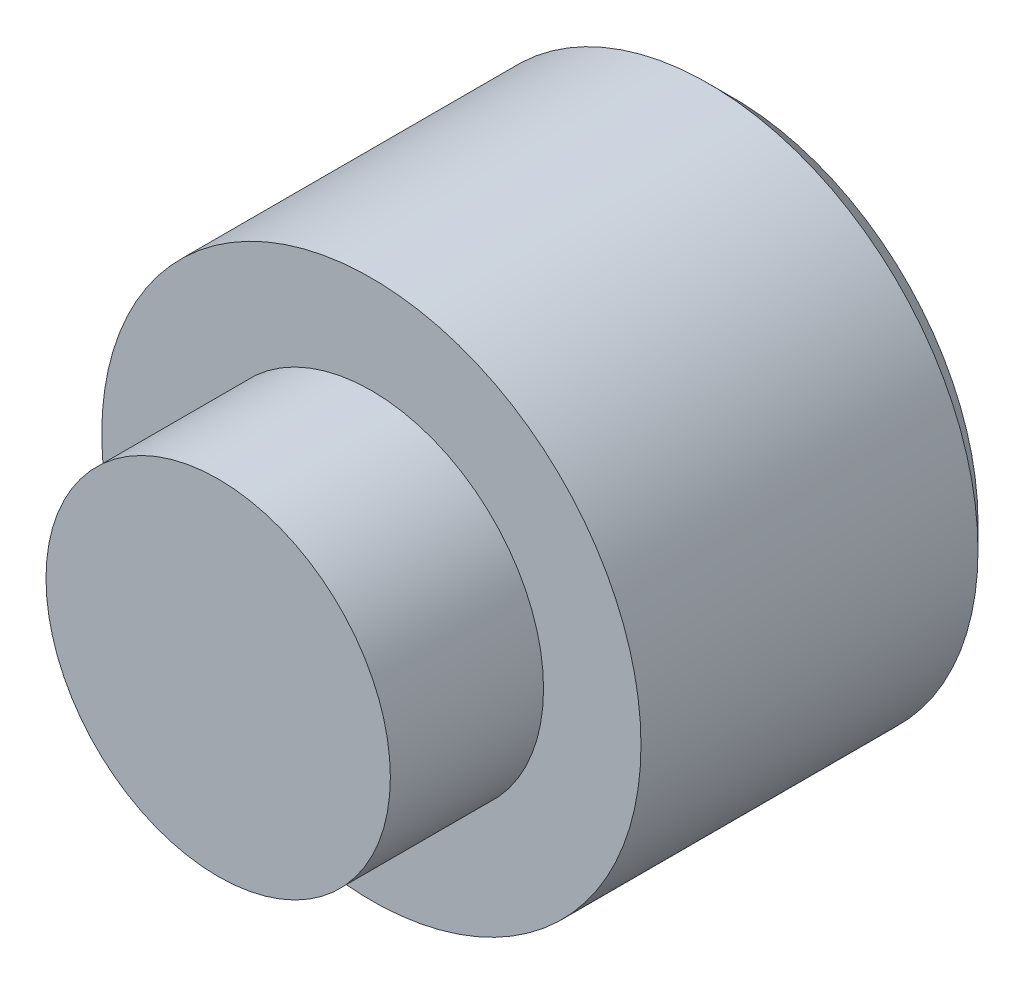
ISO-10303-21;
HEADER;
FILE_DESCRIPTION(('STEP AP214'),'2;1');
FILE_NAME('part.step','',(''),(''),'','','');
FILE_SCHEMA(('AUTOMOTIVE_DESIGN { 1 0 10303 214 1 1 1 1 }'));
ENDSEC;
DATA;
#1=APPLICATION_CONTEXT('core data for automotive mechanical design processes');
#2=APPLICATION_PROTOCOL_DEFINITION('international standard','automotive_design',2000,#1);
#3=PRODUCT_CONTEXT('',#1,'mechanical');
#4=PRODUCT('Part','Part','',(#3));
#5=PRODUCT_RELATED_PRODUCT_CATEGORY('part','',(#4));
#6=PRODUCT_DEFINITION_FORMATION('','',#4);
#7=PRODUCT_DEFINITION_CONTEXT('part definition',#1,'design');
#8=PRODUCT_DEFINITION('design','',#6,#7);
#9=PRODUCT_DEFINITION_SHAPE('','',#8);
#10=(LENGTH_UNIT() NAMED_UNIT(*) SI_UNIT(.MILLI.,.METRE.));
#11=(NAMED_UNIT(*) PLANE_ANGLE_UNIT() SI_UNIT($,.RADIAN.));
#12=(NAMED_UNIT(*) SI_UNIT($,.STERADIAN.) SOLID_ANGLE_UNIT());
#13=UNCERTAINTY_MEASURE_WITH_UNIT(LENGTH_MEASURE(1.E-05),#10,'distance_accuracy_value','');
#14=(GEOMETRIC_REPRESENTATION_CONTEXT(3) GLOBAL_UNCERTAINTY_ASSIGNED_CONTEXT((#13)) GLOBAL_UNIT_ASSIGNED_CONTEXT((#10,
#11,#12)) REPRESENTATION_CONTEXT('',''));
#15=CARTESIAN_POINT('',(0.,0.,0.));
#16=DIRECTION('',(0.,0.,1.));
#17=DIRECTION('',(1.,0.,0.));
#18=AXIS2_PLACEMENT_3D('',#15,#16,#17);
#19=CARTESIAN_POINT('',(0.,0.,3.175));
#20=DIRECTION('',(0.,0.,-1.));
#21=DIRECTION('',(-1.,0.,0.));
#22=AXIS2_PLACEMENT_3D('',#19,#20,#21);
#23=CYLINDRICAL_SURFACE('',#22,3.5687);
#24=CARTESIAN_POINT('',(0.,0.,3.175));
#25=DIRECTION('',(0.,0.,1.));
#26=DIRECTION('',(1.,0.,0.));
#27=AXIS2_PLACEMENT_3D('',#24,#25,#26);
#28=CIRCLE('',#27,3.5687);
#29=CARTESIAN_POINT('',(3.5687,0.,3.175));
#30=VERTEX_POINT('',#29);
#31=EDGE_CURVE('E46',#30,#30,#28,.T.);
#32=ORIENTED_EDGE('',*,*,#31,.F.);
#33=EDGE_LOOP('',(#32));
#34=FACE_BOUND('',#33,.T.);
#35=CARTESIAN_POINT('',(0.,0.,0.));
#36=DIRECTION('',(0.,0.,-1.));
#37=DIRECTION('',(-1.,0.,0.));
#38=AXIS2_PLACEMENT_3D('',#35,#36,#37);
#39=CIRCLE('',#38,3.5687);
#40=CARTESIAN_POINT('',(-3.5687,0.,0.));
#41=VERTEX_POINT('',#40);
#42=EDGE_CURVE('E50',#41,#41,#39,.T.);
#43=ORIENTED_EDGE('',*,*,#42,.F.);
#44=EDGE_LOOP('',(#43));
#45=FACE_BOUND('',#44,.T.);
#46=ADVANCED_FACE('F35',(#34,#45),#23,.T.);
#47=CARTESIAN_POINT('',(0.,0.,3.175));
#48=DIRECTION('',(0.,0.,1.));
#49=DIRECTION('',(1.,0.,0.));
#50=AXIS2_PLACEMENT_3D('',#47,#48,#49);
#51=PLANE('',#50);
#52=ORIENTED_EDGE('',*,*,#31,.T.);
#53=EDGE_LOOP('',(#52));
#54=FACE_BOUND('',#53,.T.);
#55=ADVANCED_FACE('F64',(#54),#51,.T.);
#56=CARTESIAN_POINT('',(0.,0.,0.));
#57=DIRECTION('',(0.,0.,-1.));
#58=DIRECTION('',(-1.,0.,0.));
#59=AXIS2_PLACEMENT_3D('',#56,#57,#58);
#60=PLANE('',#59);
#61=CARTESIAN_POINT('',(0.,0.,0.));
#62=DIRECTION('',(0.,0.,-1.));
#63=DIRECTION('',(-1.,0.,0.));
#64=AXIS2_PLACEMENT_3D('',#61,#62,#63);
#65=CIRCLE('',#64,5.588);
#66=CARTESIAN_POINT('',(-5.588,0.,0.));
#67=VERTEX_POINT('',#66);
#68=EDGE_CURVE('E55',#67,#67,#65,.T.);
#69=ORIENTED_EDGE('',*,*,#68,.F.);
#70=EDGE_LOOP('',(#69));
#71=FACE_BOUND('',#70,.T.);
#72=ORIENTED_EDGE('',*,*,#42,.T.);
#73=EDGE_LOOP('',(#72));
#74=FACE_BOUND('',#73,.T.);
#75=ADVANCED_FACE('F61',(#71,#74),#60,.F.);
#76=CARTESIAN_POINT('',(0.,0.,-7.493));
#77=DIRECTION('',(0.,0.,1.));
#78=DIRECTION('',(1.,0.,0.));
#79=AXIS2_PLACEMENT_3D('',#76,#77,#78);
#80=CYLINDRICAL_SURFACE('',#79,5.588);
#81=CARTESIAN_POINT('',(0.,0.,-6.985));
#82=DIRECTION('',(0.,0.,-1.));
#83=DIRECTION('',(-1.,0.,0.));
#84=AXIS2_PLACEMENT_3D('',#81,#82,#83);
#85=CIRCLE('',#84,5.588);
#86=CARTESIAN_POINT('',(-5.588,0.,-6.985));
#87=VERTEX_POINT('',#86);
#88=EDGE_CURVE('E10',#87,#87,#85,.F.);
#89=ORIENTED_EDGE('',*,*,#88,.T.);
#90=EDGE_LOOP('',(#89));
#91=FACE_BOUND('',#90,.T.);
#92=ORIENTED_EDGE('',*,*,#68,.T.);
#93=EDGE_LOOP('',(#92));
#94=FACE_BOUND('',#93,.T.);
#95=ADVANCED_FACE('F59',(#91,#94),#80,.T.);
#96=CARTESIAN_POINT('',(0.,0.,-7.493));
#97=DIRECTION('',(0.,0.,-1.));
#98=DIRECTION('',(-1.,0.,0.));
#99=AXIS2_PLACEMENT_3D('',#96,#97,#98);
#100=PLANE('',#99);
#101=CARTESIAN_POINT('',(0.,0.,-7.493));
#102=DIRECTION('',(0.,0.,-1.));
#103=DIRECTION('',(-1.,0.,0.));
#104=AXIS2_PLACEMENT_3D('',#101,#102,#103);
#105=CIRCLE('',#104,5.08);
#106=CARTESIAN_POINT('',(-5.08,0.,-7.493));
#107=VERTEX_POINT('',#106);
#108=EDGE_CURVE('E42',#107,#107,#105,.T.);
#109=ORIENTED_EDGE('',*,*,#108,.T.);
#110=EDGE_LOOP('',(#109));
#111=FACE_BOUND('',#110,.T.);
#112=ADVANCED_FACE('F78',(#111),#100,.T.);
#113=CARTESIAN_POINT('',(0.,0.,-7.493));
#114=DIRECTION('',(0.,0.,1.));
#115=DIRECTION('',(1.,0.,0.));
#116=AXIS2_PLACEMENT_3D('',#113,#114,#115);
#117=CONICAL_SURFACE('',#116,5.08,0.785398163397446);
#118=ORIENTED_EDGE('',*,*,#88,.F.);
#119=EDGE_LOOP('',(#118));
#120=FACE_BOUND('',#119,.T.);
#121=ORIENTED_EDGE('',*,*,#108,.F.);
#122=EDGE_LOOP('',(#121));
#123=FACE_BOUND('',#122,.T.);
#124=ADVANCED_FACE('F37',(#120,#123),#117,.T.);
#125=CLOSED_SHELL('',(#46,#55,#75,#95,#112,#124));
#126=MANIFOLD_SOLID_BREP('B2',#125);
#127=ADVANCED_BREP_SHAPE_REPRESENTATION('',(#18,#126),#14);
#128=SHAPE_DEFINITION_REPRESENTATION(#9,#127);
ENDSEC;
END-ISO-10303-21;
